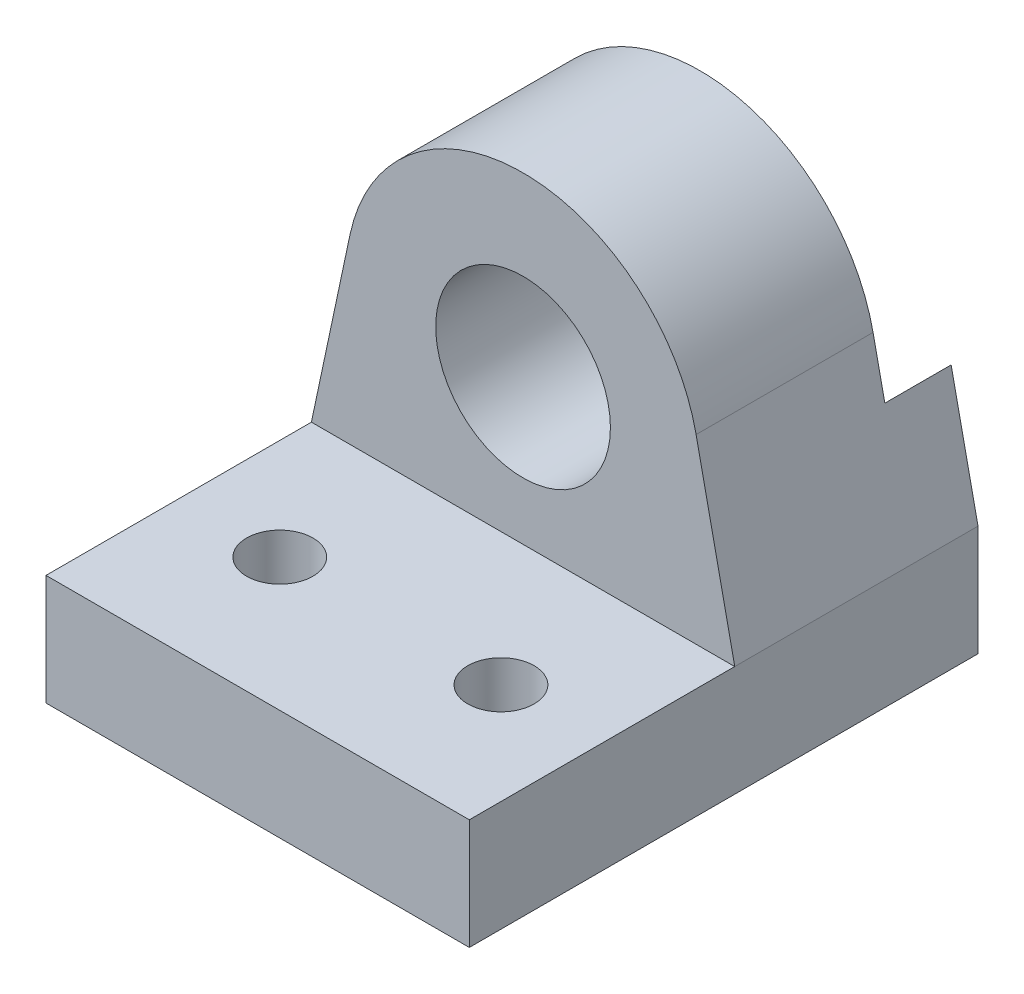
from build123d import *

# Parameters (mm, degrees)
SKETCH_1_R          = 3.95
EXTRUDE_1_DEPTH     = 8
SKETCH_3_W          = 19.14085772
SKETCH_3_H          = 20
EXTRUDE_2_DEPTH     = 5
SKETCH_4_R          = 1.5
CUT_EXTRUDE_1_DEPTH = 8
EXTRUDE_START       = 3
EXTRUDE_3_DEPTH     = 3


with BuildPart() as part:
    # Sketch 1 → Extrude 1 (new body)
    with BuildSketch(Plane.XY):
        with BuildLine():
            Line((9.57042886, -6.55), (-9.57042886, -6.55))
            Line((-9.57042886, -6.55), (-7.825285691, 1.662800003))
            ThreePointArc((-7.825285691, 1.662800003), (0, 8), (7.825285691, 1.662800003))
            Line((7.825285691, 1.662800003), (9.57042886, -6.55))
        make_face()
        Circle(SKETCH_1_R, mode=Mode.SUBTRACT)
    extrude(amount=EXTRUDE_1_DEPTH)

    # Sketch 3 → Extrude 2 (add)
    with BuildSketch(Plane.XZ.offset(6.55)):
        with Locations((0, 10)):
            Rectangle(SKETCH_3_W, SKETCH_3_H)
    extrude(amount=EXTRUDE_2_DEPTH)

    # Sketch 4 → Cut-Extrude 1 (cut)
    with BuildSketch(Plane(origin=(0, -6.55, 0), x_dir=(1, 0, 0), z_dir=(0, 1, 0))):
        with Locations(Location((-5, -14, 0), (0, 0, 180))):
            Circle(SKETCH_4_R)
        with Locations(Location((5, -14, 0), (0, 0, 180))):
            Circle(SKETCH_4_R)
    extrude(amount=-CUT_EXTRUDE_1_DEPTH, mode=Mode.SUBTRACT)

    # Sketch 6 → Extrude 3 (add)
    with BuildSketch(Plane(origin=(0, 0, 0), x_dir=(-1, 0, 0), z_dir=(0, 0, -1)).offset(EXTRUDE_START)):
        with BuildLine():
            Line((0, -11.55), (-9.57042886, -11.55))
            Line((-9.57042886, -11.55), (-9.57042886, -6.55))
            Line((-9.57042886, -6.55), (-8.357573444, -0.842193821))
            Line((-8.357573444, -0.842193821), (-7.336205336, -3.19062553))
            ThreePointArc((-7.336205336, -3.19062553), (-4.386057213, -6.690478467), (0, -8))
            Line((0, -8), (0, -11.55))
        make_face()
    extrude(amount=-EXTRUDE_3_DEPTH)


solid = part.part
